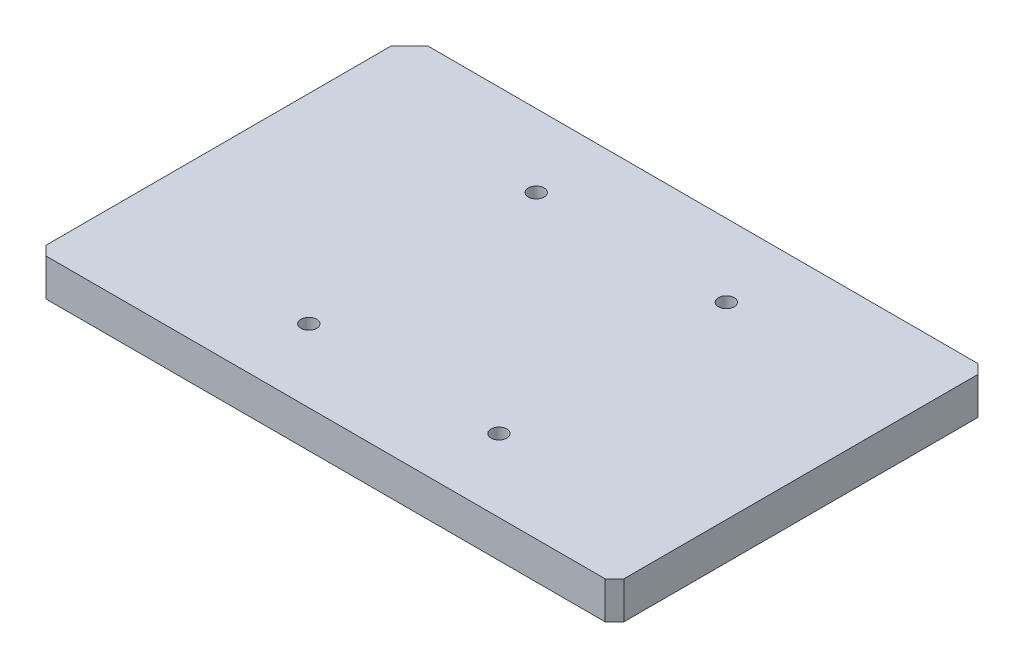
ISO-10303-21;
HEADER;
FILE_DESCRIPTION(('STEP AP214'),'2;1');
FILE_NAME('part.step','',(''),(''),'','','');
FILE_SCHEMA(('AUTOMOTIVE_DESIGN { 1 0 10303 214 1 1 1 1 }'));
ENDSEC;
DATA;
#1=APPLICATION_CONTEXT('core data for automotive mechanical design processes');
#2=APPLICATION_PROTOCOL_DEFINITION('international standard','automotive_design',2000,#1);
#3=PRODUCT_CONTEXT('',#1,'mechanical');
#4=PRODUCT('Part','Part','',(#3));
#5=PRODUCT_RELATED_PRODUCT_CATEGORY('part','',(#4));
#6=PRODUCT_DEFINITION_FORMATION('','',#4);
#7=PRODUCT_DEFINITION_CONTEXT('part definition',#1,'design');
#8=PRODUCT_DEFINITION('design','',#6,#7);
#9=PRODUCT_DEFINITION_SHAPE('','',#8);
#10=(LENGTH_UNIT() NAMED_UNIT(*) SI_UNIT(.MILLI.,.METRE.));
#11=(NAMED_UNIT(*) PLANE_ANGLE_UNIT() SI_UNIT($,.RADIAN.));
#12=(NAMED_UNIT(*) SI_UNIT($,.STERADIAN.) SOLID_ANGLE_UNIT());
#13=UNCERTAINTY_MEASURE_WITH_UNIT(LENGTH_MEASURE(1.E-05),#10,'distance_accuracy_value','');
#14=(GEOMETRIC_REPRESENTATION_CONTEXT(3) GLOBAL_UNCERTAINTY_ASSIGNED_CONTEXT((#13)) GLOBAL_UNIT_ASSIGNED_CONTEXT((#10,
#11,#12)) REPRESENTATION_CONTEXT('',''));
#15=CARTESIAN_POINT('',(0.,0.,0.));
#16=DIRECTION('',(0.,0.,1.));
#17=DIRECTION('',(1.,0.,0.));
#18=AXIS2_PLACEMENT_3D('',#15,#16,#17);
#19=CARTESIAN_POINT('',(-48.,20.001,61.));
#20=DIRECTION('',(0.,-1.,0.));
#21=DIRECTION('',(0.,0.,-1.));
#22=AXIS2_PLACEMENT_3D('',#19,#20,#21);
#23=CYLINDRICAL_SURFACE('',#22,4.25000000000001);
#24=CARTESIAN_POINT('',(-48.,20.,61.));
#25=DIRECTION('',(0.,-1.,0.));
#26=DIRECTION('',(0.,0.,-1.));
#27=AXIS2_PLACEMENT_3D('',#24,#25,#26);
#28=CIRCLE('',#27,4.25000000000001);
#29=CARTESIAN_POINT('',(-48.,20.,56.75));
#30=VERTEX_POINT('',#29);
#31=EDGE_CURVE('E152',#30,#30,#28,.F.);
#32=ORIENTED_EDGE('',*,*,#31,.T.);
#33=EDGE_LOOP('',(#32));
#34=FACE_BOUND('',#33,.T.);
#35=CARTESIAN_POINT('',(-48.,10.,61.));
#36=DIRECTION('',(0.,-1.,0.));
#37=DIRECTION('',(0.,0.,-1.));
#38=AXIS2_PLACEMENT_3D('',#35,#36,#37);
#39=CIRCLE('',#38,4.25000000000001);
#40=CARTESIAN_POINT('',(-48.,10.,56.75));
#41=VERTEX_POINT('',#40);
#42=EDGE_CURVE('E47',#41,#41,#39,.F.);
#43=ORIENTED_EDGE('',*,*,#42,.F.);
#44=EDGE_LOOP('',(#43));
#45=FACE_BOUND('',#44,.T.);
#46=ADVANCED_FACE('F43',(#34,#45),#23,.F.);
#47=CARTESIAN_POINT('',(-48.,20.001,-61.));
#48=DIRECTION('',(0.,-1.,0.));
#49=DIRECTION('',(0.,0.,-1.));
#50=AXIS2_PLACEMENT_3D('',#47,#48,#49);
#51=CYLINDRICAL_SURFACE('',#50,4.25000000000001);
#52=CARTESIAN_POINT('',(-48.,20.,-61.));
#53=DIRECTION('',(0.,-1.,0.));
#54=DIRECTION('',(0.,0.,-1.));
#55=AXIS2_PLACEMENT_3D('',#52,#53,#54);
#56=CIRCLE('',#55,4.25000000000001);
#57=CARTESIAN_POINT('',(-48.,20.,-65.25));
#58=VERTEX_POINT('',#57);
#59=EDGE_CURVE('E219',#58,#58,#56,.F.);
#60=ORIENTED_EDGE('',*,*,#59,.T.);
#61=EDGE_LOOP('',(#60));
#62=FACE_BOUND('',#61,.T.);
#63=CARTESIAN_POINT('',(-48.,10.,-61.));
#64=DIRECTION('',(0.,-1.,0.));
#65=DIRECTION('',(0.,0.,-1.));
#66=AXIS2_PLACEMENT_3D('',#63,#64,#65);
#67=CIRCLE('',#66,4.25000000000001);
#68=CARTESIAN_POINT('',(-48.,10.,-65.25));
#69=VERTEX_POINT('',#68);
#70=EDGE_CURVE('E201',#69,#69,#67,.F.);
#71=ORIENTED_EDGE('',*,*,#70,.F.);
#72=EDGE_LOOP('',(#71));
#73=FACE_BOUND('',#72,.T.);
#74=ADVANCED_FACE('F259',(#62,#73),#51,.F.);
#75=CARTESIAN_POINT('',(54.,20.001,-61.));
#76=DIRECTION('',(0.,-1.,0.));
#77=DIRECTION('',(0.,0.,-1.));
#78=AXIS2_PLACEMENT_3D('',#75,#76,#77);
#79=CYLINDRICAL_SURFACE('',#78,4.25000000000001);
#80=CARTESIAN_POINT('',(54.,20.,-61.));
#81=DIRECTION('',(0.,-1.,0.));
#82=DIRECTION('',(0.,0.,-1.));
#83=AXIS2_PLACEMENT_3D('',#80,#81,#82);
#84=CIRCLE('',#83,4.25000000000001);
#85=CARTESIAN_POINT('',(54.,20.,-65.25));
#86=VERTEX_POINT('',#85);
#87=EDGE_CURVE('E213',#86,#86,#84,.F.);
#88=ORIENTED_EDGE('',*,*,#87,.T.);
#89=EDGE_LOOP('',(#88));
#90=FACE_BOUND('',#89,.T.);
#91=CARTESIAN_POINT('',(54.,10.,-61.));
#92=DIRECTION('',(0.,-1.,0.));
#93=DIRECTION('',(0.,0.,-1.));
#94=AXIS2_PLACEMENT_3D('',#91,#92,#93);
#95=CIRCLE('',#94,4.25000000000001);
#96=CARTESIAN_POINT('',(54.,10.,-65.25));
#97=VERTEX_POINT('',#96);
#98=EDGE_CURVE('E197',#97,#97,#95,.F.);
#99=ORIENTED_EDGE('',*,*,#98,.F.);
#100=EDGE_LOOP('',(#99));
#101=FACE_BOUND('',#100,.T.);
#102=ADVANCED_FACE('F265',(#90,#101),#79,.F.);
#103=CARTESIAN_POINT('',(54.,20.001,61.));
#104=DIRECTION('',(0.,-1.,0.));
#105=DIRECTION('',(0.,0.,-1.));
#106=AXIS2_PLACEMENT_3D('',#103,#104,#105);
#107=CYLINDRICAL_SURFACE('',#106,4.25000000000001);
#108=CARTESIAN_POINT('',(54.,20.,61.));
#109=DIRECTION('',(0.,-1.,0.));
#110=DIRECTION('',(0.,0.,-1.));
#111=AXIS2_PLACEMENT_3D('',#108,#109,#110);
#112=CIRCLE('',#111,4.25000000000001);
#113=CARTESIAN_POINT('',(54.,20.,56.75));
#114=VERTEX_POINT('',#113);
#115=EDGE_CURVE('E208',#114,#114,#112,.F.);
#116=ORIENTED_EDGE('',*,*,#115,.T.);
#117=EDGE_LOOP('',(#116));
#118=FACE_BOUND('',#117,.T.);
#119=CARTESIAN_POINT('',(54.,10.,61.));
#120=DIRECTION('',(0.,-1.,0.));
#121=DIRECTION('',(0.,0.,-1.));
#122=AXIS2_PLACEMENT_3D('',#119,#120,#121);
#123=CIRCLE('',#122,4.25000000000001);
#124=CARTESIAN_POINT('',(54.,10.,56.75));
#125=VERTEX_POINT('',#124);
#126=EDGE_CURVE('E193',#125,#125,#123,.F.);
#127=ORIENTED_EDGE('',*,*,#126,.F.);
#128=EDGE_LOOP('',(#127));
#129=FACE_BOUND('',#128,.T.);
#130=ADVANCED_FACE('F256',(#118,#129),#107,.F.);
#131=CARTESIAN_POINT('',(-155.,20.,-90.));
#132=DIRECTION('',(-0.707106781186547,0.,-0.707106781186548));
#133=DIRECTION('',(-0.707106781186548,0.,0.707106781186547));
#134=AXIS2_PLACEMENT_3D('',#131,#132,#133);
#135=PLANE('',#134);
#136=DIRECTION('',(0.707106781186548,0.,-0.707106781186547));
#137=VECTOR('',#136,1.);
#138=CARTESIAN_POINT('',(-155.,0.,-90.));
#139=LINE('',#138,#137);
#140=CARTESIAN_POINT('',(-155.,0.,-90.));
#141=VERTEX_POINT('',#140);
#142=CARTESIAN_POINT('',(-145.,0.,-100.));
#143=VERTEX_POINT('',#142);
#144=EDGE_CURVE('E147',#141,#143,#139,.T.);
#145=ORIENTED_EDGE('',*,*,#144,.F.);
#146=DIRECTION('',(0.,-1.,0.));
#147=VECTOR('',#146,1.);
#148=CARTESIAN_POINT('',(-155.,20.,-90.));
#149=LINE('',#148,#147);
#150=CARTESIAN_POINT('',(-155.,20.,-90.));
#151=VERTEX_POINT('',#150);
#152=EDGE_CURVE('E11',#151,#141,#149,.T.);
#153=ORIENTED_EDGE('',*,*,#152,.F.);
#154=DIRECTION('',(0.707106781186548,0.,-0.707106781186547));
#155=VECTOR('',#154,1.);
#156=CARTESIAN_POINT('',(-155.,20.,-90.));
#157=LINE('',#156,#155);
#158=CARTESIAN_POINT('',(-145.,20.,-100.));
#159=VERTEX_POINT('',#158);
#160=EDGE_CURVE('E175',#151,#159,#157,.T.);
#161=ORIENTED_EDGE('',*,*,#160,.T.);
#162=DIRECTION('',(0.,-1.,0.));
#163=VECTOR('',#162,1.);
#164=CARTESIAN_POINT('',(-145.,20.,-100.));
#165=LINE('',#164,#163);
#166=EDGE_CURVE('E100',#159,#143,#165,.T.);
#167=ORIENTED_EDGE('',*,*,#166,.T.);
#168=EDGE_LOOP('',(#145,#153,#161,#167));
#169=FACE_BOUND('',#168,.T.);
#170=ADVANCED_FACE('F45',(#169),#135,.T.);
#171=CARTESIAN_POINT('',(-155.,20.,95.));
#172=DIRECTION('',(-1.,0.,0.));
#173=DIRECTION('',(0.,0.,1.));
#174=AXIS2_PLACEMENT_3D('',#171,#172,#173);
#175=PLANE('',#174);
#176=DIRECTION('',(0.,0.,-1.));
#177=VECTOR('',#176,1.);
#178=CARTESIAN_POINT('',(-155.,0.,95.));
#179=LINE('',#178,#177);
#180=CARTESIAN_POINT('',(-155.,0.,95.));
#181=VERTEX_POINT('',#180);
#182=EDGE_CURVE('E172',#181,#141,#179,.T.);
#183=ORIENTED_EDGE('',*,*,#182,.F.);
#184=DIRECTION('',(0.,-1.,0.));
#185=VECTOR('',#184,1.);
#186=CARTESIAN_POINT('',(-155.,20.,95.));
#187=LINE('',#186,#185);
#188=CARTESIAN_POINT('',(-155.,20.,95.));
#189=VERTEX_POINT('',#188);
#190=EDGE_CURVE('E54',#189,#181,#187,.T.);
#191=ORIENTED_EDGE('',*,*,#190,.F.);
#192=DIRECTION('',(0.,0.,-1.));
#193=VECTOR('',#192,1.);
#194=CARTESIAN_POINT('',(-155.,20.,95.));
#195=LINE('',#194,#193);
#196=EDGE_CURVE('E122',#189,#151,#195,.T.);
#197=ORIENTED_EDGE('',*,*,#196,.T.);
#198=ORIENTED_EDGE('',*,*,#152,.T.);
#199=EDGE_LOOP('',(#183,#191,#197,#198));
#200=FACE_BOUND('',#199,.T.);
#201=ADVANCED_FACE('F248',(#200),#175,.T.);
#202=CARTESIAN_POINT('',(-155.,20.,95.));
#203=DIRECTION('',(0.707106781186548,0.,-0.707106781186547));
#204=DIRECTION('',(-0.707106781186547,0.,-0.707106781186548));
#205=AXIS2_PLACEMENT_3D('',#202,#203,#204);
#206=PLANE('',#205);
#207=DIRECTION('',(0.707106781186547,0.,0.707106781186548));
#208=VECTOR('',#207,1.);
#209=CARTESIAN_POINT('',(-155.,0.,95.));
#210=LINE('',#209,#208);
#211=CARTESIAN_POINT('',(-150.,0.,100.));
#212=VERTEX_POINT('',#211);
#213=EDGE_CURVE('E128',#181,#212,#210,.T.);
#214=ORIENTED_EDGE('',*,*,#213,.T.);
#215=DIRECTION('',(0.,-1.,0.));
#216=VECTOR('',#215,1.);
#217=CARTESIAN_POINT('',(-150.,20.,100.));
#218=LINE('',#217,#216);
#219=CARTESIAN_POINT('',(-150.,20.,100.));
#220=VERTEX_POINT('',#219);
#221=EDGE_CURVE('E126',#220,#212,#218,.T.);
#222=ORIENTED_EDGE('',*,*,#221,.F.);
#223=DIRECTION('',(0.707106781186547,0.,0.707106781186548));
#224=VECTOR('',#223,1.);
#225=CARTESIAN_POINT('',(-155.,20.,95.));
#226=LINE('',#225,#224);
#227=EDGE_CURVE('E116',#189,#220,#226,.T.);
#228=ORIENTED_EDGE('',*,*,#227,.F.);
#229=ORIENTED_EDGE('',*,*,#190,.T.);
#230=EDGE_LOOP('',(#214,#222,#228,#229));
#231=FACE_BOUND('',#230,.T.);
#232=ADVANCED_FACE('F127',(#231),#206,.F.);
#233=CARTESIAN_POINT('',(-150.,20.,100.));
#234=DIRECTION('',(0.,0.,-1.));
#235=DIRECTION('',(-1.,0.,0.));
#236=AXIS2_PLACEMENT_3D('',#233,#234,#235);
#237=PLANE('',#236);
#238=DIRECTION('',(1.,0.,0.));
#239=VECTOR('',#238,1.);
#240=CARTESIAN_POINT('',(-150.,0.,100.));
#241=LINE('',#240,#239);
#242=CARTESIAN_POINT('',(150.,0.,100.));
#243=VERTEX_POINT('',#242);
#244=EDGE_CURVE('E167',#212,#243,#241,.T.);
#245=ORIENTED_EDGE('',*,*,#244,.T.);
#246=DIRECTION('',(0.,-1.,0.));
#247=VECTOR('',#246,1.);
#248=CARTESIAN_POINT('',(150.,20.,100.));
#249=LINE('',#248,#247);
#250=CARTESIAN_POINT('',(150.,20.,100.));
#251=VERTEX_POINT('',#250);
#252=EDGE_CURVE('E132',#251,#243,#249,.T.);
#253=ORIENTED_EDGE('',*,*,#252,.F.);
#254=DIRECTION('',(1.,0.,0.));
#255=VECTOR('',#254,1.);
#256=CARTESIAN_POINT('',(-150.,20.,100.));
#257=LINE('',#256,#255);
#258=EDGE_CURVE('E120',#220,#251,#257,.T.);
#259=ORIENTED_EDGE('',*,*,#258,.F.);
#260=ORIENTED_EDGE('',*,*,#221,.T.);
#261=EDGE_LOOP('',(#245,#253,#259,#260));
#262=FACE_BOUND('',#261,.T.);
#263=ADVANCED_FACE('F134',(#262),#237,.F.);
#264=CARTESIAN_POINT('',(150.,20.,100.));
#265=DIRECTION('',(-0.707106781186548,0.,-0.707106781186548));
#266=DIRECTION('',(-0.707106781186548,0.,0.707106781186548));
#267=AXIS2_PLACEMENT_3D('',#264,#265,#266);
#268=PLANE('',#267);
#269=DIRECTION('',(0.707106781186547,0.,-0.707106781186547));
#270=VECTOR('',#269,1.);
#271=CARTESIAN_POINT('',(150.,0.,100.));
#272=LINE('',#271,#270);
#273=CARTESIAN_POINT('',(155.,0.,95.));
#274=VERTEX_POINT('',#273);
#275=EDGE_CURVE('E164',#243,#274,#272,.T.);
#276=ORIENTED_EDGE('',*,*,#275,.T.);
#277=DIRECTION('',(0.,-1.,0.));
#278=VECTOR('',#277,1.);
#279=CARTESIAN_POINT('',(155.,20.,95.));
#280=LINE('',#279,#278);
#281=CARTESIAN_POINT('',(155.,20.,95.));
#282=VERTEX_POINT('',#281);
#283=EDGE_CURVE('E181',#282,#274,#280,.T.);
#284=ORIENTED_EDGE('',*,*,#283,.F.);
#285=DIRECTION('',(0.707106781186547,0.,-0.707106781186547));
#286=VECTOR('',#285,1.);
#287=CARTESIAN_POINT('',(150.,20.,100.));
#288=LINE('',#287,#286);
#289=EDGE_CURVE('E138',#251,#282,#288,.T.);
#290=ORIENTED_EDGE('',*,*,#289,.F.);
#291=ORIENTED_EDGE('',*,*,#252,.T.);
#292=EDGE_LOOP('',(#276,#284,#290,#291));
#293=FACE_BOUND('',#292,.T.);
#294=ADVANCED_FACE('F401',(#293),#268,.F.);
#295=CARTESIAN_POINT('',(155.,20.,95.));
#296=DIRECTION('',(-1.,0.,0.));
#297=DIRECTION('',(0.,0.,1.));
#298=AXIS2_PLACEMENT_3D('',#295,#296,#297);
#299=PLANE('',#298);
#300=DIRECTION('',(0.,0.,-1.));
#301=VECTOR('',#300,1.);
#302=CARTESIAN_POINT('',(155.,0.,95.));
#303=LINE('',#302,#301);
#304=CARTESIAN_POINT('',(155.,0.,-95.));
#305=VERTEX_POINT('',#304);
#306=EDGE_CURVE('E160',#274,#305,#303,.T.);
#307=ORIENTED_EDGE('',*,*,#306,.T.);
#308=DIRECTION('',(0.,-1.,0.));
#309=VECTOR('',#308,1.);
#310=CARTESIAN_POINT('',(155.,20.,-95.));
#311=LINE('',#310,#309);
#312=CARTESIAN_POINT('',(155.,20.,-95.));
#313=VERTEX_POINT('',#312);
#314=EDGE_CURVE('E185',#313,#305,#311,.T.);
#315=ORIENTED_EDGE('',*,*,#314,.F.);
#316=DIRECTION('',(0.,0.,-1.));
#317=VECTOR('',#316,1.);
#318=CARTESIAN_POINT('',(155.,20.,95.));
#319=LINE('',#318,#317);
#320=EDGE_CURVE('E141',#282,#313,#319,.T.);
#321=ORIENTED_EDGE('',*,*,#320,.F.);
#322=ORIENTED_EDGE('',*,*,#283,.T.);
#323=EDGE_LOOP('',(#307,#315,#321,#322));
#324=FACE_BOUND('',#323,.T.);
#325=ADVANCED_FACE('F240',(#324),#299,.F.);
#326=CARTESIAN_POINT('',(150.,20.,-100.));
#327=DIRECTION('',(0.707106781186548,0.,-0.707106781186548));
#328=DIRECTION('',(-0.707106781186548,0.,-0.707106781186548));
#329=AXIS2_PLACEMENT_3D('',#326,#327,#328);
#330=PLANE('',#329);
#331=DIRECTION('',(0.707106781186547,0.,0.707106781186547));
#332=VECTOR('',#331,1.);
#333=CARTESIAN_POINT('',(150.,0.,-100.));
#334=LINE('',#333,#332);
#335=CARTESIAN_POINT('',(150.,0.,-100.));
#336=VERTEX_POINT('',#335);
#337=EDGE_CURVE('E156',#336,#305,#334,.T.);
#338=ORIENTED_EDGE('',*,*,#337,.F.);
#339=DIRECTION('',(0.,-1.,0.));
#340=VECTOR('',#339,1.);
#341=CARTESIAN_POINT('',(150.,20.,-100.));
#342=LINE('',#341,#340);
#343=CARTESIAN_POINT('',(150.,20.,-100.));
#344=VERTEX_POINT('',#343);
#345=EDGE_CURVE('E188',#344,#336,#342,.T.);
#346=ORIENTED_EDGE('',*,*,#345,.F.);
#347=DIRECTION('',(0.707106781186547,0.,0.707106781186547));
#348=VECTOR('',#347,1.);
#349=CARTESIAN_POINT('',(150.,20.,-100.));
#350=LINE('',#349,#348);
#351=EDGE_CURVE('E231',#344,#313,#350,.T.);
#352=ORIENTED_EDGE('',*,*,#351,.T.);
#353=ORIENTED_EDGE('',*,*,#314,.T.);
#354=EDGE_LOOP('',(#338,#346,#352,#353));
#355=FACE_BOUND('',#354,.T.);
#356=ADVANCED_FACE('F244',(#355),#330,.T.);
#357=CARTESIAN_POINT('',(-145.,20.,-100.));
#358=DIRECTION('',(0.,0.,-1.));
#359=DIRECTION('',(-1.,0.,0.));
#360=AXIS2_PLACEMENT_3D('',#357,#358,#359);
#361=PLANE('',#360);
#362=DIRECTION('',(1.,0.,0.));
#363=VECTOR('',#362,1.);
#364=CARTESIAN_POINT('',(-145.,0.,-100.));
#365=LINE('',#364,#363);
#366=EDGE_CURVE('E151',#143,#336,#365,.T.);
#367=ORIENTED_EDGE('',*,*,#366,.F.);
#368=ORIENTED_EDGE('',*,*,#166,.F.);
#369=DIRECTION('',(1.,0.,0.));
#370=VECTOR('',#369,1.);
#371=CARTESIAN_POINT('',(-145.,20.,-100.));
#372=LINE('',#371,#370);
#373=EDGE_CURVE('E228',#159,#344,#372,.T.);
#374=ORIENTED_EDGE('',*,*,#373,.T.);
#375=ORIENTED_EDGE('',*,*,#345,.T.);
#376=EDGE_LOOP('',(#367,#368,#374,#375));
#377=FACE_BOUND('',#376,.T.);
#378=ADVANCED_FACE('F245',(#377),#361,.T.);
#379=CARTESIAN_POINT('',(0.,20.,0.));
#380=DIRECTION('',(0.,-1.,0.));
#381=DIRECTION('',(0.,0.,-1.));
#382=AXIS2_PLACEMENT_3D('',#379,#380,#381);
#383=PLANE('',#382);
#384=ORIENTED_EDGE('',*,*,#115,.F.);
#385=EDGE_LOOP('',(#384));
#386=FACE_BOUND('',#385,.T.);
#387=ORIENTED_EDGE('',*,*,#87,.F.);
#388=EDGE_LOOP('',(#387));
#389=FACE_BOUND('',#388,.T.);
#390=ORIENTED_EDGE('',*,*,#59,.F.);
#391=EDGE_LOOP('',(#390));
#392=FACE_BOUND('',#391,.T.);
#393=ORIENTED_EDGE('',*,*,#31,.F.);
#394=EDGE_LOOP('',(#393));
#395=FACE_BOUND('',#394,.T.);
#396=ORIENTED_EDGE('',*,*,#160,.F.);
#397=ORIENTED_EDGE('',*,*,#196,.F.);
#398=ORIENTED_EDGE('',*,*,#227,.T.);
#399=ORIENTED_EDGE('',*,*,#258,.T.);
#400=ORIENTED_EDGE('',*,*,#289,.T.);
#401=ORIENTED_EDGE('',*,*,#320,.T.);
#402=ORIENTED_EDGE('',*,*,#351,.F.);
#403=ORIENTED_EDGE('',*,*,#373,.F.);
#404=EDGE_LOOP('',(#396,#397,#398,#399,#400,#401,#402,#403));
#405=FACE_BOUND('',#404,.T.);
#406=ADVANCED_FACE('F118',(#386,#389,#392,#395,#405),#383,.F.);
#407=CARTESIAN_POINT('',(0.,0.,0.));
#408=DIRECTION('',(0.,-1.,0.));
#409=DIRECTION('',(0.,0.,-1.));
#410=AXIS2_PLACEMENT_3D('',#407,#408,#409);
#411=PLANE('',#410);
#412=CARTESIAN_POINT('',(-48.,0.,-61.));
#413=DIRECTION('',(0.,-1.,0.));
#414=DIRECTION('',(0.,0.,-1.));
#415=AXIS2_PLACEMENT_3D('',#412,#413,#414);
#416=CIRCLE('',#415,7.5);
#417=CARTESIAN_POINT('',(-48.,0.,-68.5));
#418=VERTEX_POINT('',#417);
#419=EDGE_CURVE('E286',#418,#418,#416,.T.);
#420=ORIENTED_EDGE('',*,*,#419,.F.);
#421=EDGE_LOOP('',(#420));
#422=FACE_BOUND('',#421,.T.);
#423=CARTESIAN_POINT('',(54.,0.,-61.));
#424=DIRECTION('',(0.,-1.,0.));
#425=DIRECTION('',(0.,0.,-1.));
#426=AXIS2_PLACEMENT_3D('',#423,#424,#425);
#427=CIRCLE('',#426,7.5);
#428=CARTESIAN_POINT('',(54.,0.,-68.5));
#429=VERTEX_POINT('',#428);
#430=EDGE_CURVE('E290',#429,#429,#427,.T.);
#431=ORIENTED_EDGE('',*,*,#430,.F.);
#432=EDGE_LOOP('',(#431));
#433=FACE_BOUND('',#432,.T.);
#434=CARTESIAN_POINT('',(54.,0.,61.));
#435=DIRECTION('',(0.,-1.,0.));
#436=DIRECTION('',(0.,0.,-1.));
#437=AXIS2_PLACEMENT_3D('',#434,#435,#436);
#438=CIRCLE('',#437,7.5);
#439=CARTESIAN_POINT('',(54.,0.,53.5));
#440=VERTEX_POINT('',#439);
#441=EDGE_CURVE('E294',#440,#440,#438,.T.);
#442=ORIENTED_EDGE('',*,*,#441,.F.);
#443=EDGE_LOOP('',(#442));
#444=FACE_BOUND('',#443,.T.);
#445=CARTESIAN_POINT('',(-48.,0.,61.));
#446=DIRECTION('',(0.,-1.,0.));
#447=DIRECTION('',(0.,0.,-1.));
#448=AXIS2_PLACEMENT_3D('',#445,#446,#447);
#449=CIRCLE('',#448,7.5);
#450=CARTESIAN_POINT('',(-48.,0.,53.5));
#451=VERTEX_POINT('',#450);
#452=EDGE_CURVE('E297',#451,#451,#449,.T.);
#453=ORIENTED_EDGE('',*,*,#452,.F.);
#454=EDGE_LOOP('',(#453));
#455=FACE_BOUND('',#454,.T.);
#456=ORIENTED_EDGE('',*,*,#144,.T.);
#457=ORIENTED_EDGE('',*,*,#366,.T.);
#458=ORIENTED_EDGE('',*,*,#337,.T.);
#459=ORIENTED_EDGE('',*,*,#306,.F.);
#460=ORIENTED_EDGE('',*,*,#275,.F.);
#461=ORIENTED_EDGE('',*,*,#244,.F.);
#462=ORIENTED_EDGE('',*,*,#213,.F.);
#463=ORIENTED_EDGE('',*,*,#182,.T.);
#464=EDGE_LOOP('',(#456,#457,#458,#459,#460,#461,#462,#463));
#465=FACE_BOUND('',#464,.T.);
#466=ADVANCED_FACE('F247',(#422,#433,#444,#455,#465),#411,.T.);
#467=CARTESIAN_POINT('',(54.,10.,61.));
#468=DIRECTION('',(0.,-1.,0.));
#469=DIRECTION('',(0.,0.,-1.));
#470=AXIS2_PLACEMENT_3D('',#467,#468,#469);
#471=PLANE('',#470);
#472=CARTESIAN_POINT('',(54.,10.,61.));
#473=DIRECTION('',(0.,-1.,0.));
#474=DIRECTION('',(0.,0.,-1.));
#475=AXIS2_PLACEMENT_3D('',#472,#473,#474);
#476=CIRCLE('',#475,7.5);
#477=CARTESIAN_POINT('',(54.,10.,53.5));
#478=VERTEX_POINT('',#477);
#479=EDGE_CURVE('E305',#478,#478,#476,.T.);
#480=ORIENTED_EDGE('',*,*,#479,.T.);
#481=EDGE_LOOP('',(#480));
#482=FACE_BOUND('',#481,.T.);
#483=ORIENTED_EDGE('',*,*,#126,.T.);
#484=EDGE_LOOP('',(#483));
#485=FACE_BOUND('',#484,.T.);
#486=ADVANCED_FACE('F275',(#482,#485),#471,.T.);
#487=CARTESIAN_POINT('',(54.,10.,61.));
#488=DIRECTION('',(0.,-1.,0.));
#489=DIRECTION('',(0.,0.,-1.));
#490=AXIS2_PLACEMENT_3D('',#487,#488,#489);
#491=CYLINDRICAL_SURFACE('',#490,7.5);
#492=ORIENTED_EDGE('',*,*,#479,.F.);
#493=EDGE_LOOP('',(#492));
#494=FACE_BOUND('',#493,.T.);
#495=ORIENTED_EDGE('',*,*,#441,.T.);
#496=EDGE_LOOP('',(#495));
#497=FACE_BOUND('',#496,.T.);
#498=ADVANCED_FACE('F280',(#494,#497),#491,.F.);
#499=CARTESIAN_POINT('',(54.,10.,-61.));
#500=DIRECTION('',(0.,-1.,0.));
#501=DIRECTION('',(0.,0.,-1.));
#502=AXIS2_PLACEMENT_3D('',#499,#500,#501);
#503=PLANE('',#502);
#504=CARTESIAN_POINT('',(54.,10.,-61.));
#505=DIRECTION('',(0.,-1.,0.));
#506=DIRECTION('',(0.,0.,-1.));
#507=AXIS2_PLACEMENT_3D('',#504,#505,#506);
#508=CIRCLE('',#507,7.5);
#509=CARTESIAN_POINT('',(54.,10.,-68.5));
#510=VERTEX_POINT('',#509);
#511=EDGE_CURVE('E321',#510,#510,#508,.T.);
#512=ORIENTED_EDGE('',*,*,#511,.T.);
#513=EDGE_LOOP('',(#512));
#514=FACE_BOUND('',#513,.T.);
#515=ORIENTED_EDGE('',*,*,#98,.T.);
#516=EDGE_LOOP('',(#515));
#517=FACE_BOUND('',#516,.T.);
#518=ADVANCED_FACE('F334',(#514,#517),#503,.T.);
#519=CARTESIAN_POINT('',(54.,10.,-61.));
#520=DIRECTION('',(0.,-1.,0.));
#521=DIRECTION('',(0.,0.,-1.));
#522=AXIS2_PLACEMENT_3D('',#519,#520,#521);
#523=CYLINDRICAL_SURFACE('',#522,7.5);
#524=ORIENTED_EDGE('',*,*,#511,.F.);
#525=EDGE_LOOP('',(#524));
#526=FACE_BOUND('',#525,.T.);
#527=ORIENTED_EDGE('',*,*,#430,.T.);
#528=EDGE_LOOP('',(#527));
#529=FACE_BOUND('',#528,.T.);
#530=ADVANCED_FACE('F339',(#526,#529),#523,.F.);
#531=CARTESIAN_POINT('',(-48.,10.,-61.));
#532=DIRECTION('',(0.,-1.,0.));
#533=DIRECTION('',(0.,0.,-1.));
#534=AXIS2_PLACEMENT_3D('',#531,#532,#533);
#535=PLANE('',#534);
#536=CARTESIAN_POINT('',(-48.,10.,-61.));
#537=DIRECTION('',(0.,-1.,0.));
#538=DIRECTION('',(0.,0.,-1.));
#539=AXIS2_PLACEMENT_3D('',#536,#537,#538);
#540=CIRCLE('',#539,7.5);
#541=CARTESIAN_POINT('',(-48.,10.,-68.5));
#542=VERTEX_POINT('',#541);
#543=EDGE_CURVE('E315',#542,#542,#540,.T.);
#544=ORIENTED_EDGE('',*,*,#543,.T.);
#545=EDGE_LOOP('',(#544));
#546=FACE_BOUND('',#545,.T.);
#547=ORIENTED_EDGE('',*,*,#70,.T.);
#548=EDGE_LOOP('',(#547));
#549=FACE_BOUND('',#548,.T.);
#550=ADVANCED_FACE('F344',(#546,#549),#535,.T.);
#551=CARTESIAN_POINT('',(-48.,10.,-61.));
#552=DIRECTION('',(0.,-1.,0.));
#553=DIRECTION('',(0.,0.,-1.));
#554=AXIS2_PLACEMENT_3D('',#551,#552,#553);
#555=CYLINDRICAL_SURFACE('',#554,7.5);
#556=ORIENTED_EDGE('',*,*,#543,.F.);
#557=EDGE_LOOP('',(#556));
#558=FACE_BOUND('',#557,.T.);
#559=ORIENTED_EDGE('',*,*,#419,.T.);
#560=EDGE_LOOP('',(#559));
#561=FACE_BOUND('',#560,.T.);
#562=ADVANCED_FACE('F347',(#558,#561),#555,.F.);
#563=CARTESIAN_POINT('',(-48.,10.,61.));
#564=DIRECTION('',(0.,-1.,0.));
#565=DIRECTION('',(0.,0.,-1.));
#566=AXIS2_PLACEMENT_3D('',#563,#564,#565);
#567=PLANE('',#566);
#568=CARTESIAN_POINT('',(-48.,10.,61.));
#569=DIRECTION('',(0.,-1.,0.));
#570=DIRECTION('',(0.,0.,-1.));
#571=AXIS2_PLACEMENT_3D('',#568,#569,#570);
#572=CIRCLE('',#571,7.5);
#573=CARTESIAN_POINT('',(-48.,10.,53.5));
#574=VERTEX_POINT('',#573);
#575=EDGE_CURVE('E198',#574,#574,#572,.T.);
#576=ORIENTED_EDGE('',*,*,#575,.T.);
#577=EDGE_LOOP('',(#576));
#578=FACE_BOUND('',#577,.T.);
#579=ORIENTED_EDGE('',*,*,#42,.T.);
#580=EDGE_LOOP('',(#579));
#581=FACE_BOUND('',#580,.T.);
#582=ADVANCED_FACE('F350',(#578,#581),#567,.T.);
#583=CARTESIAN_POINT('',(-48.,10.,61.));
#584=DIRECTION('',(0.,-1.,0.));
#585=DIRECTION('',(0.,0.,-1.));
#586=AXIS2_PLACEMENT_3D('',#583,#584,#585);
#587=CYLINDRICAL_SURFACE('',#586,7.5);
#588=ORIENTED_EDGE('',*,*,#575,.F.);
#589=EDGE_LOOP('',(#588));
#590=FACE_BOUND('',#589,.T.);
#591=ORIENTED_EDGE('',*,*,#452,.T.);
#592=EDGE_LOOP('',(#591));
#593=FACE_BOUND('',#592,.T.);
#594=ADVANCED_FACE('F357',(#590,#593),#587,.F.);
#595=CLOSED_SHELL('',(#46,#74,#102,#130,#170,#201,#232,#263,#294,#325,#356,#378,#406,#466,#486,
#498,#518,#530,#550,#562,#582,#594));
#596=MANIFOLD_SOLID_BREP('B2',#595);
#597=ADVANCED_BREP_SHAPE_REPRESENTATION('',(#18,#596),#14);
#598=SHAPE_DEFINITION_REPRESENTATION(#9,#597);
ENDSEC;
END-ISO-10303-21;
